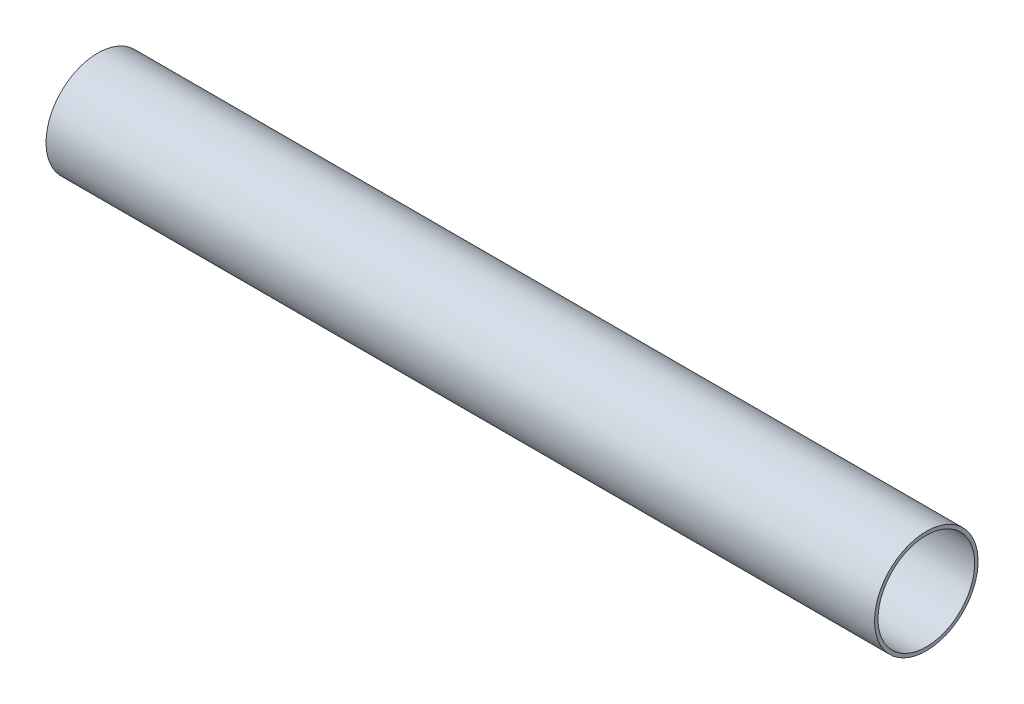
from build123d import *

# Parameters (mm, degrees)
SKETCH1_R           = 19.05
SKETCH1_R_2         = 17.78
BOSS_EXTRUDE1_DEPTH = 304.8


with BuildPart() as part:
    # Sketch1 → Boss-Extrude1 (new body)
    with BuildSketch(Plane(origin=(0, 0, 0), x_dir=(0, 0, -1), z_dir=(1, 0, 0))):
        with Locations(Location((0, 0, 0), (0, 0, 180))):
            Circle(SKETCH1_R)
        with Locations(Location((0, 0, 0), (0, 0, 180))):
            Circle(SKETCH1_R_2, mode=Mode.SUBTRACT)
    extrude(amount=BOSS_EXTRUDE1_DEPTH)


solid = part.part
